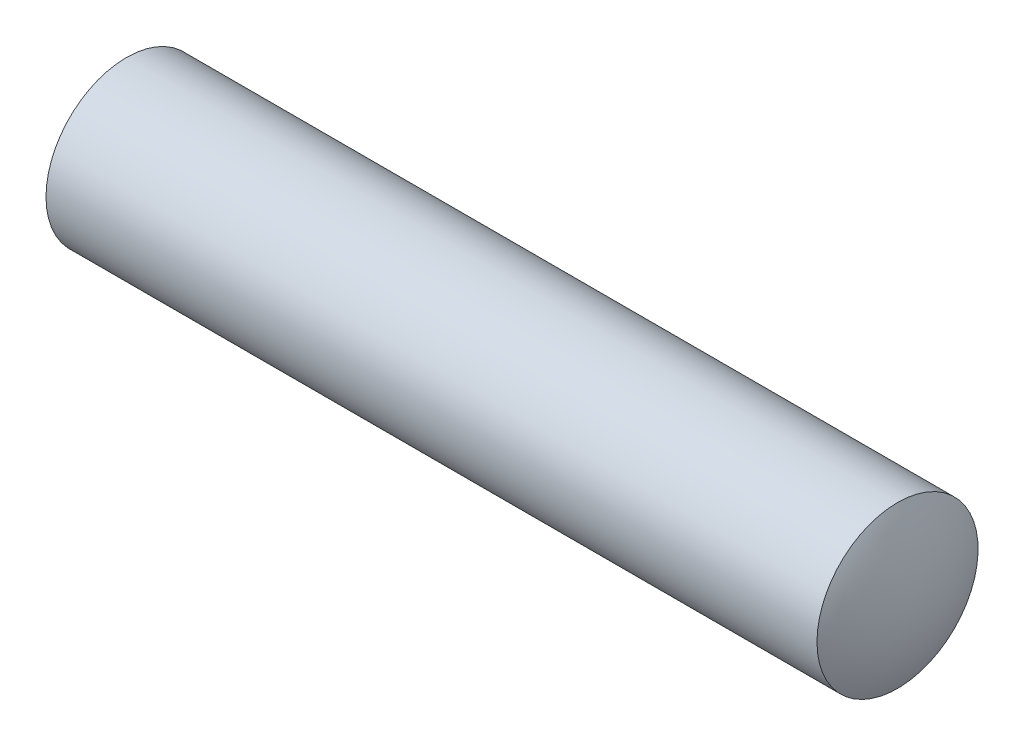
ISO-10303-21;
HEADER;
FILE_DESCRIPTION(('STEP AP214'),'2;1');
FILE_NAME('part.step','',(''),(''),'','','');
FILE_SCHEMA(('AUTOMOTIVE_DESIGN { 1 0 10303 214 1 1 1 1 }'));
ENDSEC;
DATA;
#1=APPLICATION_CONTEXT('core data for automotive mechanical design processes');
#2=APPLICATION_PROTOCOL_DEFINITION('international standard','automotive_design',2000,#1);
#3=PRODUCT_CONTEXT('',#1,'mechanical');
#4=PRODUCT('Part','Part','',(#3));
#5=PRODUCT_RELATED_PRODUCT_CATEGORY('part','',(#4));
#6=PRODUCT_DEFINITION_FORMATION('','',#4);
#7=PRODUCT_DEFINITION_CONTEXT('part definition',#1,'design');
#8=PRODUCT_DEFINITION('design','',#6,#7);
#9=PRODUCT_DEFINITION_SHAPE('','',#8);
#10=(LENGTH_UNIT() NAMED_UNIT(*) SI_UNIT(.MILLI.,.METRE.));
#11=(NAMED_UNIT(*) PLANE_ANGLE_UNIT() SI_UNIT($,.RADIAN.));
#12=(NAMED_UNIT(*) SI_UNIT($,.STERADIAN.) SOLID_ANGLE_UNIT());
#13=UNCERTAINTY_MEASURE_WITH_UNIT(LENGTH_MEASURE(1.E-05),#10,'distance_accuracy_value','');
#14=(GEOMETRIC_REPRESENTATION_CONTEXT(3) GLOBAL_UNCERTAINTY_ASSIGNED_CONTEXT((#13)) GLOBAL_UNIT_ASSIGNED_CONTEXT((#10,
#11,#12)) REPRESENTATION_CONTEXT('',''));
#15=CARTESIAN_POINT('',(0.,0.,0.));
#16=DIRECTION('',(0.,0.,1.));
#17=DIRECTION('',(1.,0.,0.));
#18=AXIS2_PLACEMENT_3D('',#15,#16,#17);
#19=CARTESIAN_POINT('',(-5.80977500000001,0.,0.));
#20=DIRECTION('',(-1.,0.,0.));
#21=DIRECTION('',(0.,1.,0.));
#22=AXIS2_PLACEMENT_3D('',#19,#20,#21);
#23=SPHERICAL_SURFACE('',#22,4.19022499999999);
#24=CARTESIAN_POINT('',(-9.5,0.,0.));
#25=DIRECTION('',(-1.,0.,0.));
#26=DIRECTION('',(0.,0.,1.));
#27=AXIS2_PLACEMENT_3D('',#24,#25,#26);
#28=CIRCLE('',#27,1.985);
#29=CARTESIAN_POINT('',(-9.5,0.,1.985));
#30=VERTEX_POINT('',#29);
#31=EDGE_CURVE('E35',#30,#30,#28,.T.);
#32=ORIENTED_EDGE('',*,*,#31,.T.);
#33=EDGE_LOOP('',(#32));
#34=FACE_BOUND('',#33,.T.);
#35=ADVANCED_FACE('F29',(#34),#23,.T.);
#36=CARTESIAN_POINT('',(5.809775,0.,0.));
#37=DIRECTION('',(-1.,0.,0.));
#38=DIRECTION('',(0.,1.,0.));
#39=AXIS2_PLACEMENT_3D('',#36,#37,#38);
#40=SPHERICAL_SURFACE('',#39,4.190225);
#41=CARTESIAN_POINT('',(9.5,0.,0.));
#42=DIRECTION('',(-1.,0.,0.));
#43=DIRECTION('',(0.,0.,1.));
#44=AXIS2_PLACEMENT_3D('',#41,#42,#43);
#45=CIRCLE('',#44,1.985);
#46=CARTESIAN_POINT('',(9.5,0.,1.985));
#47=VERTEX_POINT('',#46);
#48=EDGE_CURVE('E10',#47,#47,#45,.T.);
#49=ORIENTED_EDGE('',*,*,#48,.F.);
#50=EDGE_LOOP('',(#49));
#51=FACE_BOUND('',#50,.T.);
#52=ADVANCED_FACE('F44',(#51),#40,.T.);
#53=CARTESIAN_POINT('',(-10.,0.,0.));
#54=DIRECTION('',(-1.,0.,0.));
#55=DIRECTION('',(0.,0.,1.));
#56=AXIS2_PLACEMENT_3D('',#53,#54,#55);
#57=CYLINDRICAL_SURFACE('',#56,1.985);
#58=ORIENTED_EDGE('',*,*,#31,.F.);
#59=EDGE_LOOP('',(#58));
#60=FACE_BOUND('',#59,.T.);
#61=ORIENTED_EDGE('',*,*,#48,.T.);
#62=EDGE_LOOP('',(#61));
#63=FACE_BOUND('',#62,.T.);
#64=ADVANCED_FACE('F42',(#60,#63),#57,.T.);
#65=CLOSED_SHELL('',(#35,#52,#64));
#66=MANIFOLD_SOLID_BREP('B2',#65);
#67=ADVANCED_BREP_SHAPE_REPRESENTATION('',(#18,#66),#14);
#68=SHAPE_DEFINITION_REPRESENTATION(#9,#67);
ENDSEC;
END-ISO-10303-21;
